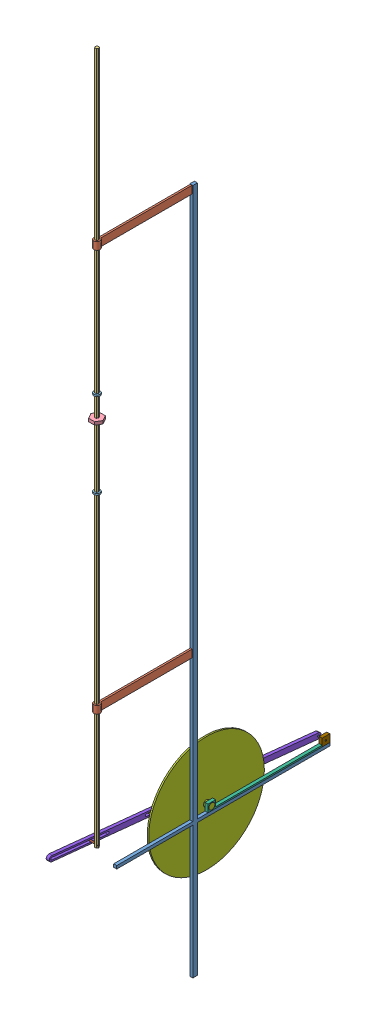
SolidWorks assembly holder3.SLDASM, configuration Default (file format 7000). Lengths in mm.
Overall size (111.17 5601.31 1795.23).
15 component instances, 11 part files, 13 mates.
Components (placement in the parent):
- holder beam-1: holder beam.SLDPRT [Default] at (-6.7917 -864.1033 19.4917) size (20 4510 1400)
- holder arm-1: holder arm.SLDPRT [Default] at (3.2083 1795.8967 639.4917) size (40 50 640)
- holder arm-2: holder arm.SLDPRT [Default] at (3.2083 -844.1033 639.4917) size (40 50 640)
- shafty-1: shafty.SLDASM [Default] at (949.9378 1012.8613 312.9274) x (-0.999786 -0.004201 0.020264) z (-0.02047 0.056848 -0.998173) size (81.47 4543.81 279.1) (flexible)
  - shaft-1: shaft.SLDPRT [Default] at (964.1752 -2599.9771 -455.8555) x (0.999786 0.003042 0.02047) z (-0.020264 -0.056922 0.998173) size (23.09 4550 20)
  - weight-1: weight.SLDPRT [Default] at (953.981 -177.3921 -317.9115) x (0.999786 0.003042 0.02047) z (-0.020264 -0.056922 0.998173) size (80 20 69.28)
  - stop-2: stop.SLDPRT [Default] at (953.3515 -27.8048 -309.3939) x (-0.999786 -0.003042 -0.02047) z (0.020264 0.056922 -0.998173) size (40 10 40)
  - stop-6: stop.SLDPRT [Default] at (955.7098 -588.2474 -341.306) x (-0.999786 -0.003042 -0.02047) z (0.020264 0.056922 -0.998173) size (40 10 40)
- fws-1: fws.SLDASM [Default] at (3.5668 -1752.3627 -103.4831) size (71.55 1039.54 1778.6) (flexible)
  - fw holder-1: fw holder.SLDPRT [Default] at (-10.3585 -21.7406 22.9748) size (20 50 750)
  - flywheel-1: flywheel.SLDPRT [Default] at (-35.3585 3.2594 -2.0252) x (1 0 0) z (0 0.298887 0.954289) size (70 760 760)
  - qr handle-1: qr handle.SLDPRT [Default] at (-60.3585 3.2594 -752.0252) x (1 0 0) z (0 -0.100657 -0.994921) size (20 35 1795)
  - qr handle holder-1: qr handle holder.SLDPRT [Default] at (-10.3585 -21.7406 -727.0252) size (20 50 50)
  - pin qr-1: pin qr.SLDPRT [Default] at (-60.3585 3.2594 -752.0252) size (70 10 10)
  - pin666-1: pin666.SLDPRT [Default] at (11.1885 154.5092 742.9748) x (0 0 -1) z (1 0 0) size (10 10 71.55)
Mates (geometry in assembly coordinates):
- Coincident1: coincident: moEndPointRef_w of holder beam-1; moEndPointRef_w of holder arm-1
- Coincident2: coincident: line of holder beam-1 through (-6.7917 1845.8967 19.4917) axis (1 0 0); line of holder arm-1 through (-2.5652 1845.8967 19.4917) axis (1 0 0)
- Coincident3: coincident: plane of holder beam-1 through (-6.7917 1845.8967 19.4917) normal (0 0 1); plane of holder arm-2 through (3.2083 -844.1033 19.4917) normal (0 0 -1)
- Parallel2: parallel: line of holder beam-1 through (13.2083 -2664.1033 19.4917) axis (-1 0 0); line of holder arm-2 through (8.9818 -844.1033 19.4917) axis (-1 0 0)
- Coincident38: coincident: line of holder beam-1 through (-6.7917 -1774.1033 -880.5083) axis (1 0 0); line of fws-1/qr handle holder-1 through (13.2083 -1774.1033 -880.5083) axis (-1 0 0)
- Coincident39: coincident: line of holder beam-1 through (-6.7917 -1794.1033 -880.5083) axis (0 1 0); line of fws-1/qr handle holder-1 through (-6.7917 -1774.1033 -880.5083) axis (0 1 0)
- Coincident44: coincident: plane of holder beam-1 through (-6.7917 1845.8967 19.4917) normal (0 0 1); line of holder arm-1 through (1.2083 1795.8967 19.4917) axis (-1 0 0)
- Parallel7: parallel: line of holder beam-1 through (-6.7917 1845.8967 -10.5083) axis (0 -1 0); line of shafty-1/shaft-1 through (-2.5652 3254.7525 649.4917) axis (0 -1 0)
- Coincident45: coincident: plane of holder arm-1 through (8.9818 1845.8967 629.4917) normal (0 0 1); plane of shafty-1/shaft-1 through (8.9818 3254.7525 629.4917) normal (0 0 -1)
- Coincident48: coincident: plane of holder arm-1 through (-2.5652 1845.8967 629.4917) normal (0.866025 0 0.5); plane of shafty-1/shaft-1 through (-2.5652 3254.7525 629.4917) normal (-0.866025 0 -0.5)
- Coincident50: coincident: point of assembly; moEndPointRef_w of holder arm-2
- Slot2: slot anti-aligned: cylinder of ? through (-56.7917 -2108.7522 639.4917) axis (1 0 0) radius 5; cylinder of ? through (-36.7917 -1760.7453 904.4532) axis (-1 0 0) radius 7.5
- Hinge1: hinge: cylinder of ? through (-56.7917 -1280.2475 639.4917) axis (1 0 0) radius 5; cylinder of shafty-1/shaft-1 through (-8.3387 -1280.2475 639.4917) axis (1 0 0) radius 5; plane of ? through (14.7553 -1280.2475 639.4917) normal (1 0 0); line of shafty-1/shaft-1 through (14.7553 3254.7525 639.4917) axis (0 -1 0)
